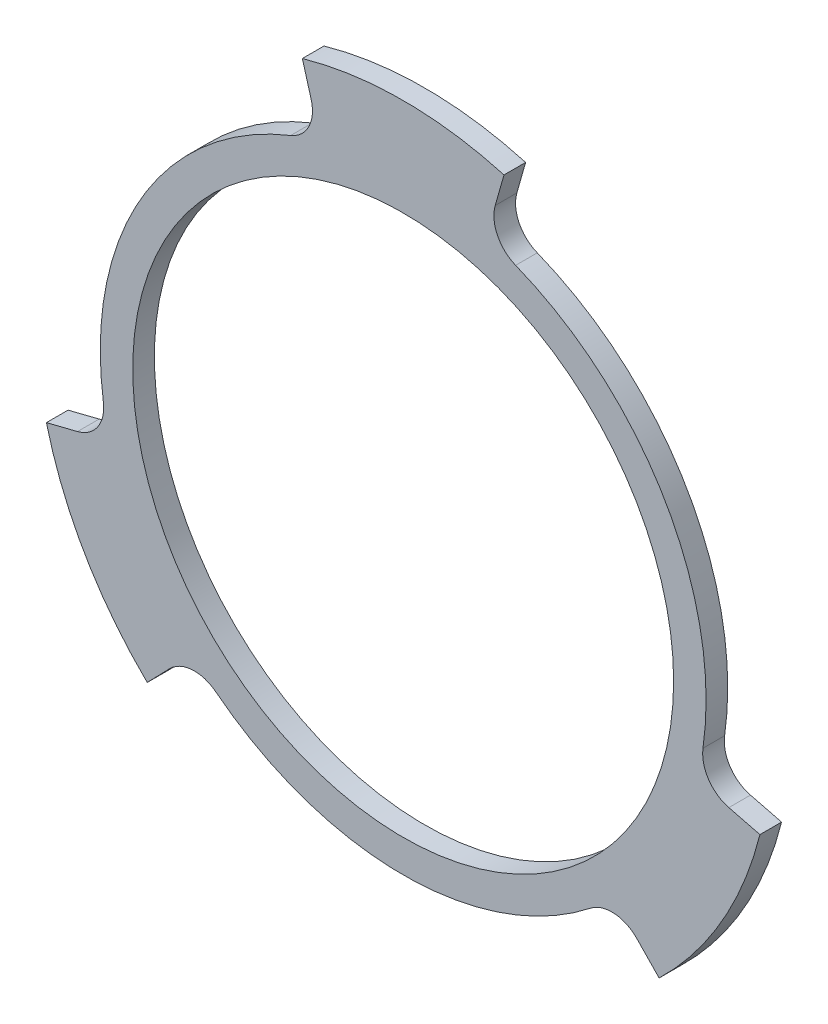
ISO-10303-21;
HEADER;
FILE_DESCRIPTION(('STEP AP214'),'2;1');
FILE_NAME('part.step','',(''),(''),'','','');
FILE_SCHEMA(('AUTOMOTIVE_DESIGN { 1 0 10303 214 1 1 1 1 }'));
ENDSEC;
DATA;
#1=APPLICATION_CONTEXT('core data for automotive mechanical design processes');
#2=APPLICATION_PROTOCOL_DEFINITION('international standard','automotive_design',2000,#1);
#3=PRODUCT_CONTEXT('',#1,'mechanical');
#4=PRODUCT('Part','Part','',(#3));
#5=PRODUCT_RELATED_PRODUCT_CATEGORY('part','',(#4));
#6=PRODUCT_DEFINITION_FORMATION('','',#4);
#7=PRODUCT_DEFINITION_CONTEXT('part definition',#1,'design');
#8=PRODUCT_DEFINITION('design','',#6,#7);
#9=PRODUCT_DEFINITION_SHAPE('','',#8);
#10=(LENGTH_UNIT() NAMED_UNIT(*) SI_UNIT(.MILLI.,.METRE.));
#11=(NAMED_UNIT(*) PLANE_ANGLE_UNIT() SI_UNIT($,.RADIAN.));
#12=(NAMED_UNIT(*) SI_UNIT($,.STERADIAN.) SOLID_ANGLE_UNIT());
#13=UNCERTAINTY_MEASURE_WITH_UNIT(LENGTH_MEASURE(1.E-05),#10,'distance_accuracy_value','');
#14=(GEOMETRIC_REPRESENTATION_CONTEXT(3) GLOBAL_UNCERTAINTY_ASSIGNED_CONTEXT((#13)) GLOBAL_UNIT_ASSIGNED_CONTEXT((#10,
#11,#12)) REPRESENTATION_CONTEXT('',''));
#15=CARTESIAN_POINT('',(0.,0.,0.));
#16=DIRECTION('',(0.,0.,1.));
#17=DIRECTION('',(1.,0.,0.));
#18=AXIS2_PLACEMENT_3D('',#15,#16,#17);
#19=CARTESIAN_POINT('',(0.,0.,1.5875));
#20=DIRECTION('',(0.,0.,-1.));
#21=DIRECTION('',(-1.,0.,0.));
#22=AXIS2_PLACEMENT_3D('',#19,#20,#21);
#23=CYLINDRICAL_SURFACE('',#22,22.225);
#24=CARTESIAN_POINT('',(0.,0.,0.));
#25=DIRECTION('',(0.,0.,1.));
#26=DIRECTION('',(1.,0.,0.));
#27=AXIS2_PLACEMENT_3D('',#24,#25,#26);
#28=CIRCLE('',#27,22.225);
#29=CARTESIAN_POINT('',(13.7457100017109,-17.4644233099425,0.));
#30=VERTEX_POINT('',#29);
#31=CARTESIAN_POINT('',(-13.7457100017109,-17.4644233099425,0.));
#32=VERTEX_POINT('',#31);
#33=EDGE_CURVE('E175',#30,#32,#28,.F.);
#34=ORIENTED_EDGE('',*,*,#33,.F.);
#35=DIRECTION('',(0.,0.,-1.));
#36=VECTOR('',#35,1.);
#37=CARTESIAN_POINT('',(13.7457100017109,-17.4644233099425,1.5875));
#38=LINE('',#37,#36);
#39=CARTESIAN_POINT('',(13.7457100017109,-17.4644233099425,1.5875));
#40=VERTEX_POINT('',#39);
#41=EDGE_CURVE('E277',#30,#40,#38,.F.);
#42=ORIENTED_EDGE('',*,*,#41,.T.);
#43=CARTESIAN_POINT('',(0.,0.,1.5875));
#44=DIRECTION('',(0.,0.,1.));
#45=DIRECTION('',(1.,0.,0.));
#46=AXIS2_PLACEMENT_3D('',#43,#44,#45);
#47=CIRCLE('',#46,22.225);
#48=CARTESIAN_POINT('',(-13.7457100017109,-17.4644233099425,1.5875));
#49=VERTEX_POINT('',#48);
#50=EDGE_CURVE('E213',#40,#49,#47,.F.);
#51=ORIENTED_EDGE('',*,*,#50,.T.);
#52=DIRECTION('',(0.,0.,-1.));
#53=VECTOR('',#52,1.);
#54=CARTESIAN_POINT('',(-13.7457100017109,-17.4644233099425,1.5875));
#55=LINE('',#54,#53);
#56=EDGE_CURVE('E274',#49,#32,#55,.T.);
#57=ORIENTED_EDGE('',*,*,#56,.T.);
#58=EDGE_LOOP('',(#34,#42,#51,#57));
#59=FACE_BOUND('',#58,.T.);
#60=ADVANCED_FACE('F31',(#59),#23,.T.);
#61=CARTESIAN_POINT('',(30.0624460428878,-31.0306665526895,1.5875));
#62=DIRECTION('',(-0.718223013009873,-0.695812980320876,0.));
#63=DIRECTION('',(0.695812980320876,-0.718223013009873,0.));
#64=AXIS2_PLACEMENT_3D('',#61,#62,#63);
#65=PLANE('',#64);
#66=DIRECTION('',(-0.695812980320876,0.718223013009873,0.));
#67=VECTOR('',#66,1.);
#68=CARTESIAN_POINT('',(30.0624460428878,-31.0306665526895,1.5875));
#69=LINE('',#68,#67);
#70=CARTESIAN_POINT('',(18.7782528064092,-19.3830435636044,1.5875));
#71=VERTEX_POINT('',#70);
#72=CARTESIAN_POINT('',(17.1409347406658,-17.6929924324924,1.5875));
#73=VERTEX_POINT('',#72);
#74=EDGE_CURVE('E216',#71,#73,#69,.T.);
#75=ORIENTED_EDGE('',*,*,#74,.T.);
#76=DIRECTION('',(0.,0.,1.));
#77=VECTOR('',#76,1.);
#78=CARTESIAN_POINT('',(17.1409347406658,-17.6929924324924,0.));
#79=LINE('',#78,#77);
#80=CARTESIAN_POINT('',(17.1409347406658,-17.6929924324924,0.));
#81=VERTEX_POINT('',#80);
#82=EDGE_CURVE('E173',#73,#81,#79,.F.);
#83=ORIENTED_EDGE('',*,*,#82,.T.);
#84=DIRECTION('',(-0.695812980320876,0.718223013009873,0.));
#85=VECTOR('',#84,1.);
#86=CARTESIAN_POINT('',(30.0624460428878,-31.0306665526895,0.));
#87=LINE('',#86,#85);
#88=CARTESIAN_POINT('',(18.7782528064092,-19.3830435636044,0.));
#89=VERTEX_POINT('',#88);
#90=EDGE_CURVE('E170',#89,#81,#87,.T.);
#91=ORIENTED_EDGE('',*,*,#90,.F.);
#92=DIRECTION('',(0.,0.,-1.));
#93=VECTOR('',#92,1.);
#94=CARTESIAN_POINT('',(18.7782528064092,-19.3830435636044,1.5875));
#95=LINE('',#94,#93);
#96=EDGE_CURVE('E155',#71,#89,#95,.T.);
#97=ORIENTED_EDGE('',*,*,#96,.F.);
#98=EDGE_LOOP('',(#75,#83,#91,#97));
#99=FACE_BOUND('',#98,.T.);
#100=ADVANCED_FACE('F171',(#99),#65,.T.);
#101=CARTESIAN_POINT('',(0.,0.,1.5875));
#102=DIRECTION('',(0.,0.,-1.));
#103=DIRECTION('',(-1.,0.,0.));
#104=AXIS2_PLACEMENT_3D('',#101,#102,#103);
#105=CYLINDRICAL_SURFACE('',#104,26.9875);
#106=CARTESIAN_POINT('',(0.,0.,0.));
#107=DIRECTION('',(0.,0.,1.));
#108=DIRECTION('',(1.,0.,0.));
#109=AXIS2_PLACEMENT_3D('',#106,#107,#108);
#110=CIRCLE('',#109,26.9875);
#111=CARTESIAN_POINT('',(26.1753345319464,-6.57092218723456,0.));
#112=VERTEX_POINT('',#111);
#113=EDGE_CURVE('E159',#112,#89,#110,.F.);
#114=ORIENTED_EDGE('',*,*,#113,.F.);
#115=DIRECTION('',(0.,0.,-1.));
#116=VECTOR('',#115,1.);
#117=CARTESIAN_POINT('',(26.1753345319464,-6.57092218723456,1.5875));
#118=LINE('',#117,#116);
#119=CARTESIAN_POINT('',(26.1753345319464,-6.57092218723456,1.5875));
#120=VERTEX_POINT('',#119);
#121=EDGE_CURVE('E166',#120,#112,#118,.T.);
#122=ORIENTED_EDGE('',*,*,#121,.F.);
#123=CARTESIAN_POINT('',(0.,0.,1.5875));
#124=DIRECTION('',(0.,0.,1.));
#125=DIRECTION('',(1.,0.,0.));
#126=AXIS2_PLACEMENT_3D('',#123,#124,#125);
#127=CIRCLE('',#126,26.9875);
#128=EDGE_CURVE('E161',#120,#71,#127,.F.);
#129=ORIENTED_EDGE('',*,*,#128,.T.);
#130=ORIENTED_EDGE('',*,*,#96,.T.);
#131=EDGE_LOOP('',(#114,#122,#129,#130));
#132=FACE_BOUND('',#131,.T.);
#133=ADVANCED_FACE('F157',(#132),#105,.T.);
#134=CARTESIAN_POINT('',(16.8141900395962,-4.22094832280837,1.5875));
#135=DIRECTION('',(-0.243480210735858,-0.969905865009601,0.));
#136=DIRECTION('',(0.969905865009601,-0.243480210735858,0.));
#137=AXIS2_PLACEMENT_3D('',#134,#135,#136);
#138=PLANE('',#137);
#139=DIRECTION('',(-0.969905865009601,0.243480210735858,0.));
#140=VECTOR('',#139,1.);
#141=CARTESIAN_POINT('',(16.8141900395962,-4.22094832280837,0.));
#142=LINE('',#141,#140);
#143=CARTESIAN_POINT('',(23.8930482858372,-5.99798871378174,0.));
#144=VERTEX_POINT('',#143);
#145=EDGE_CURVE('E181',#112,#144,#142,.T.);
#146=ORIENTED_EDGE('',*,*,#145,.T.);
#147=DIRECTION('',(0.,0.,1.));
#148=VECTOR('',#147,1.);
#149=CARTESIAN_POINT('',(23.8930482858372,-5.99798871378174,1.5875));
#150=LINE('',#149,#148);
#151=CARTESIAN_POINT('',(23.8930482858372,-5.99798871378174,1.5875));
#152=VERTEX_POINT('',#151);
#153=EDGE_CURVE('E268',#144,#152,#150,.T.);
#154=ORIENTED_EDGE('',*,*,#153,.T.);
#155=DIRECTION('',(-0.969905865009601,0.243480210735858,0.));
#156=VECTOR('',#155,1.);
#157=CARTESIAN_POINT('',(16.8141900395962,-4.22094832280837,1.5875));
#158=LINE('',#157,#156);
#159=EDGE_CURVE('E219',#120,#152,#158,.T.);
#160=ORIENTED_EDGE('',*,*,#159,.F.);
#161=ORIENTED_EDGE('',*,*,#121,.T.);
#162=EDGE_LOOP('',(#146,#154,#160,#161));
#163=FACE_BOUND('',#162,.T.);
#164=ADVANCED_FACE('F380',(#163),#138,.F.);
#165=CARTESIAN_POINT('',(0.,0.,1.5875));
#166=DIRECTION('',(0.,0.,-1.));
#167=DIRECTION('',(-1.,0.,0.));
#168=AXIS2_PLACEMENT_3D('',#165,#166,#167);
#169=CYLINDRICAL_SURFACE('',#168,22.225);
#170=CARTESIAN_POINT('',(0.,0.,1.5875));
#171=DIRECTION('',(0.,0.,1.));
#172=DIRECTION('',(1.,0.,0.));
#173=AXIS2_PLACEMENT_3D('',#170,#171,#172);
#174=CIRCLE('',#173,22.225);
#175=CARTESIAN_POINT('',(21.9974892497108,-3.17192239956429,1.5875));
#176=VERTEX_POINT('',#175);
#177=CARTESIAN_POINT('',(8.25177924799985,20.6363457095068,1.5875));
#178=VERTEX_POINT('',#177);
#179=EDGE_CURVE('E222',#176,#178,#174,.T.);
#180=ORIENTED_EDGE('',*,*,#179,.F.);
#181=DIRECTION('',(0.,0.,-1.));
#182=VECTOR('',#181,1.);
#183=CARTESIAN_POINT('',(21.9974892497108,-3.17192239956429,1.5875));
#184=LINE('',#183,#182);
#185=CARTESIAN_POINT('',(21.9974892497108,-3.17192239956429,0.));
#186=VERTEX_POINT('',#185);
#187=EDGE_CURVE('E265',#176,#186,#184,.T.);
#188=ORIENTED_EDGE('',*,*,#187,.T.);
#189=CARTESIAN_POINT('',(0.,0.,0.));
#190=DIRECTION('',(0.,0.,1.));
#191=DIRECTION('',(1.,0.,0.));
#192=AXIS2_PLACEMENT_3D('',#189,#190,#191);
#193=CIRCLE('',#192,22.225);
#194=CARTESIAN_POINT('',(8.25177924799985,20.6363457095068,0.));
#195=VERTEX_POINT('',#194);
#196=EDGE_CURVE('E183',#186,#195,#193,.T.);
#197=ORIENTED_EDGE('',*,*,#196,.T.);
#198=DIRECTION('',(0.,0.,-1.));
#199=VECTOR('',#198,1.);
#200=CARTESIAN_POINT('',(8.25177924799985,20.6363457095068,1.5875));
#201=LINE('',#200,#199);
#202=EDGE_CURVE('E263',#195,#178,#201,.F.);
#203=ORIENTED_EDGE('',*,*,#202,.T.);
#204=EDGE_LOOP('',(#180,#188,#197,#203));
#205=FACE_BOUND('',#204,.T.);
#206=ADVANCED_FACE('F343',(#205),#169,.T.);
#207=CARTESIAN_POINT('',(-14.6457615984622,-51.38723743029,1.5875));
#208=DIRECTION('',(0.961703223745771,-0.274092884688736,0.));
#209=DIRECTION('',(0.274092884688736,0.961703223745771,0.));
#210=AXIS2_PLACEMENT_3D('',#207,#208,#209);
#211=PLANE('',#210);
#212=DIRECTION('',(-0.274092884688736,-0.961703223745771,0.));
#213=VECTOR('',#212,1.);
#214=CARTESIAN_POINT('',(-14.6457615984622,-51.38723743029,1.5875));
#215=LINE('',#214,#213);
#216=CARTESIAN_POINT('',(7.39708172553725,25.953965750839,1.5875));
#217=VERTEX_POINT('',#216);
#218=CARTESIAN_POINT('',(6.7521135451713,23.6909811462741,1.5875));
#219=VERTEX_POINT('',#218);
#220=EDGE_CURVE('E225',#217,#219,#215,.T.);
#221=ORIENTED_EDGE('',*,*,#220,.T.);
#222=DIRECTION('',(0.,0.,-1.));
#223=VECTOR('',#222,1.);
#224=CARTESIAN_POINT('',(6.75211354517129,23.6909811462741,1.5875));
#225=LINE('',#224,#223);
#226=CARTESIAN_POINT('',(6.7521135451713,23.6909811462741,0.));
#227=VERTEX_POINT('',#226);
#228=EDGE_CURVE('E270',#219,#227,#225,.T.);
#229=ORIENTED_EDGE('',*,*,#228,.T.);
#230=DIRECTION('',(-0.274092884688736,-0.961703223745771,0.));
#231=VECTOR('',#230,1.);
#232=CARTESIAN_POINT('',(-14.6457615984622,-51.38723743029,0.));
#233=LINE('',#232,#231);
#234=CARTESIAN_POINT('',(7.39708172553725,25.953965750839,0.));
#235=VERTEX_POINT('',#234);
#236=EDGE_CURVE('E189',#235,#227,#233,.T.);
#237=ORIENTED_EDGE('',*,*,#236,.F.);
#238=DIRECTION('',(0.,0.,-1.));
#239=VECTOR('',#238,1.);
#240=CARTESIAN_POINT('',(7.39708172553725,25.953965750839,1.5875));
#241=LINE('',#240,#239);
#242=EDGE_CURVE('E254',#217,#235,#241,.T.);
#243=ORIENTED_EDGE('',*,*,#242,.F.);
#244=EDGE_LOOP('',(#221,#229,#237,#243));
#245=FACE_BOUND('',#244,.T.);
#246=ADVANCED_FACE('F351',(#245),#211,.T.);
#247=CARTESIAN_POINT('',(0.,0.,1.5875));
#248=DIRECTION('',(0.,0.,-1.));
#249=DIRECTION('',(-1.,0.,0.));
#250=AXIS2_PLACEMENT_3D('',#247,#248,#249);
#251=CYLINDRICAL_SURFACE('',#250,26.9875);
#252=CARTESIAN_POINT('',(0.,0.,0.));
#253=DIRECTION('',(0.,0.,1.));
#254=DIRECTION('',(1.,0.,0.));
#255=AXIS2_PLACEMENT_3D('',#252,#253,#254);
#256=CIRCLE('',#255,26.9875);
#257=CARTESIAN_POINT('',(-7.39708172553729,25.953965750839,0.));
#258=VERTEX_POINT('',#257);
#259=EDGE_CURVE('E192',#258,#235,#256,.F.);
#260=ORIENTED_EDGE('',*,*,#259,.F.);
#261=DIRECTION('',(0.,0.,-1.));
#262=VECTOR('',#261,1.);
#263=CARTESIAN_POINT('',(-7.39708172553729,25.953965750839,1.5875));
#264=LINE('',#263,#262);
#265=CARTESIAN_POINT('',(-7.39708172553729,25.953965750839,1.5875));
#266=VERTEX_POINT('',#265);
#267=EDGE_CURVE('E252',#266,#258,#264,.T.);
#268=ORIENTED_EDGE('',*,*,#267,.F.);
#269=CARTESIAN_POINT('',(0.,0.,1.5875));
#270=DIRECTION('',(0.,0.,1.));
#271=DIRECTION('',(1.,0.,0.));
#272=AXIS2_PLACEMENT_3D('',#269,#270,#271);
#273=CIRCLE('',#272,26.9875);
#274=EDGE_CURVE('E228',#266,#217,#273,.F.);
#275=ORIENTED_EDGE('',*,*,#274,.T.);
#276=ORIENTED_EDGE('',*,*,#242,.T.);
#277=EDGE_LOOP('',(#260,#268,#275,#276));
#278=FACE_BOUND('',#277,.T.);
#279=ADVANCED_FACE('F356',(#278),#251,.T.);
#280=CARTESIAN_POINT('',(15.1962634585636,-53.3187702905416,1.5875));
#281=DIRECTION('',(0.96170322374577,0.274092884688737,0.));
#282=DIRECTION('',(-0.274092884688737,0.96170322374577,0.));
#283=AXIS2_PLACEMENT_3D('',#280,#281,#282);
#284=PLANE('',#283);
#285=DIRECTION('',(0.274092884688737,-0.96170322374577,0.));
#286=VECTOR('',#285,1.);
#287=CARTESIAN_POINT('',(15.1962634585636,-53.3187702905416,0.));
#288=LINE('',#287,#286);
#289=CARTESIAN_POINT('',(-6.75211354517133,23.6909811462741,0.));
#290=VERTEX_POINT('',#289);
#291=EDGE_CURVE('E195',#258,#290,#288,.T.);
#292=ORIENTED_EDGE('',*,*,#291,.T.);
#293=DIRECTION('',(0.,0.,-1.));
#294=VECTOR('',#293,1.);
#295=CARTESIAN_POINT('',(-6.75211354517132,23.6909811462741,1.5875));
#296=LINE('',#295,#294);
#297=CARTESIAN_POINT('',(-6.75211354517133,23.6909811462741,1.5875));
#298=VERTEX_POINT('',#297);
#299=EDGE_CURVE('E261',#290,#298,#296,.F.);
#300=ORIENTED_EDGE('',*,*,#299,.T.);
#301=DIRECTION('',(0.274092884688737,-0.96170322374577,0.));
#302=VECTOR('',#301,1.);
#303=CARTESIAN_POINT('',(15.1962634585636,-53.3187702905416,1.5875));
#304=LINE('',#303,#302);
#305=EDGE_CURVE('E231',#266,#298,#304,.T.);
#306=ORIENTED_EDGE('',*,*,#305,.F.);
#307=ORIENTED_EDGE('',*,*,#267,.T.);
#308=EDGE_LOOP('',(#292,#300,#306,#307));
#309=FACE_BOUND('',#308,.T.);
#310=ADVANCED_FACE('F360',(#309),#284,.F.);
#311=CARTESIAN_POINT('',(0.,0.,1.5875));
#312=DIRECTION('',(0.,0.,-1.));
#313=DIRECTION('',(-1.,0.,0.));
#314=AXIS2_PLACEMENT_3D('',#311,#312,#313);
#315=CYLINDRICAL_SURFACE('',#314,22.225);
#316=CARTESIAN_POINT('',(0.,0.,1.5875));
#317=DIRECTION('',(0.,0.,1.));
#318=DIRECTION('',(1.,0.,0.));
#319=AXIS2_PLACEMENT_3D('',#316,#317,#318);
#320=CIRCLE('',#319,22.225);
#321=CARTESIAN_POINT('',(-21.9974892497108,-3.17192239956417,1.5875));
#322=VERTEX_POINT('',#321);
#323=CARTESIAN_POINT('',(-8.25177924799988,20.6363457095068,1.5875));
#324=VERTEX_POINT('',#323);
#325=EDGE_CURVE('E234',#322,#324,#320,.F.);
#326=ORIENTED_EDGE('',*,*,#325,.T.);
#327=DIRECTION('',(0.,0.,-1.));
#328=VECTOR('',#327,1.);
#329=CARTESIAN_POINT('',(-8.25177924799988,20.6363457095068,1.5875));
#330=LINE('',#329,#328);
#331=CARTESIAN_POINT('',(-8.25177924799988,20.6363457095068,0.));
#332=VERTEX_POINT('',#331);
#333=EDGE_CURVE('E258',#324,#332,#330,.T.);
#334=ORIENTED_EDGE('',*,*,#333,.T.);
#335=CARTESIAN_POINT('',(0.,0.,0.));
#336=DIRECTION('',(0.,0.,1.));
#337=DIRECTION('',(1.,0.,0.));
#338=AXIS2_PLACEMENT_3D('',#335,#336,#337);
#339=CIRCLE('',#338,22.225);
#340=CARTESIAN_POINT('',(-21.9974892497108,-3.17192239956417,0.));
#341=VERTEX_POINT('',#340);
#342=EDGE_CURVE('E198',#341,#332,#339,.F.);
#343=ORIENTED_EDGE('',*,*,#342,.F.);
#344=DIRECTION('',(0.,0.,-1.));
#345=VECTOR('',#344,1.);
#346=CARTESIAN_POINT('',(-21.9974892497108,-3.17192239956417,1.5875));
#347=LINE('',#346,#345);
#348=EDGE_CURVE('E165',#341,#322,#347,.F.);
#349=ORIENTED_EDGE('',*,*,#348,.T.);
#350=EDGE_LOOP('',(#326,#334,#343,#349));
#351=FACE_BOUND('',#350,.T.);
#352=ADVANCED_FACE('F305',(#351),#315,.T.);
#353=CARTESIAN_POINT('',(-9.92096529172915,-2.4905084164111,1.5875));
#354=DIRECTION('',(-0.243480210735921,0.969905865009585,0.));
#355=DIRECTION('',(-0.969905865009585,-0.243480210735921,0.));
#356=AXIS2_PLACEMENT_3D('',#353,#354,#355);
#357=PLANE('',#356);
#358=DIRECTION('',(0.969905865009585,0.243480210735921,0.));
#359=VECTOR('',#358,1.);
#360=CARTESIAN_POINT('',(-9.92096529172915,-2.4905084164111,1.5875));
#361=LINE('',#360,#359);
#362=CARTESIAN_POINT('',(-26.1753345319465,-6.57092218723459,1.5875));
#363=VERTEX_POINT('',#362);
#364=CARTESIAN_POINT('',(-23.8930482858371,-5.99798871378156,1.5875));
#365=VERTEX_POINT('',#364);
#366=EDGE_CURVE('E237',#363,#365,#361,.T.);
#367=ORIENTED_EDGE('',*,*,#366,.T.);
#368=DIRECTION('',(0.,0.,1.));
#369=VECTOR('',#368,1.);
#370=CARTESIAN_POINT('',(-23.8930482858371,-5.99798871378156,0.));
#371=LINE('',#370,#369);
#372=CARTESIAN_POINT('',(-23.8930482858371,-5.99798871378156,0.));
#373=VERTEX_POINT('',#372);
#374=EDGE_CURVE('E281',#365,#373,#371,.F.);
#375=ORIENTED_EDGE('',*,*,#374,.T.);
#376=DIRECTION('',(0.969905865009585,0.243480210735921,0.));
#377=VECTOR('',#376,1.);
#378=CARTESIAN_POINT('',(-9.92096529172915,-2.4905084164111,0.));
#379=LINE('',#378,#377);
#380=CARTESIAN_POINT('',(-26.1753345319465,-6.57092218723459,0.));
#381=VERTEX_POINT('',#380);
#382=EDGE_CURVE('E201',#381,#373,#379,.T.);
#383=ORIENTED_EDGE('',*,*,#382,.F.);
#384=DIRECTION('',(0.,0.,-1.));
#385=VECTOR('',#384,1.);
#386=CARTESIAN_POINT('',(-26.1753345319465,-6.57092218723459,1.5875));
#387=LINE('',#386,#385);
#388=EDGE_CURVE('E250',#363,#381,#387,.T.);
#389=ORIENTED_EDGE('',*,*,#388,.F.);
#390=EDGE_LOOP('',(#367,#375,#383,#389));
#391=FACE_BOUND('',#390,.T.);
#392=ADVANCED_FACE('F309',(#391),#357,.T.);
#393=CARTESIAN_POINT('',(0.,0.,1.5875));
#394=DIRECTION('',(0.,0.,-1.));
#395=DIRECTION('',(-1.,0.,0.));
#396=AXIS2_PLACEMENT_3D('',#393,#394,#395);
#397=CYLINDRICAL_SURFACE('',#396,26.9875);
#398=CARTESIAN_POINT('',(0.,0.,0.));
#399=DIRECTION('',(0.,0.,1.));
#400=DIRECTION('',(1.,0.,0.));
#401=AXIS2_PLACEMENT_3D('',#398,#399,#400);
#402=CIRCLE('',#401,26.9875);
#403=CARTESIAN_POINT('',(-18.7782528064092,-19.3830435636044,0.));
#404=VERTEX_POINT('',#403);
#405=EDGE_CURVE('E204',#404,#381,#402,.F.);
#406=ORIENTED_EDGE('',*,*,#405,.F.);
#407=DIRECTION('',(0.,0.,-1.));
#408=VECTOR('',#407,1.);
#409=CARTESIAN_POINT('',(-18.7782528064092,-19.3830435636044,1.5875));
#410=LINE('',#409,#408);
#411=CARTESIAN_POINT('',(-18.7782528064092,-19.3830435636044,1.5875));
#412=VERTEX_POINT('',#411);
#413=EDGE_CURVE('E248',#412,#404,#410,.T.);
#414=ORIENTED_EDGE('',*,*,#413,.F.);
#415=CARTESIAN_POINT('',(0.,0.,1.5875));
#416=DIRECTION('',(0.,0.,1.));
#417=DIRECTION('',(1.,0.,0.));
#418=AXIS2_PLACEMENT_3D('',#415,#416,#417);
#419=CIRCLE('',#418,26.9875);
#420=EDGE_CURVE('E239',#412,#363,#419,.F.);
#421=ORIENTED_EDGE('',*,*,#420,.T.);
#422=ORIENTED_EDGE('',*,*,#388,.T.);
#423=EDGE_LOOP('',(#406,#414,#421,#422));
#424=FACE_BOUND('',#423,.T.);
#425=ADVANCED_FACE('F316',(#424),#397,.T.);
#426=CARTESIAN_POINT('',(-26.5147343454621,-27.3686937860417,1.5875));
#427=DIRECTION('',(-0.718223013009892,0.695812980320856,0.));
#428=DIRECTION('',(-0.695812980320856,-0.718223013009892,0.));
#429=AXIS2_PLACEMENT_3D('',#426,#427,#428);
#430=PLANE('',#429);
#431=DIRECTION('',(0.695812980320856,0.718223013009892,0.));
#432=VECTOR('',#431,1.);
#433=CARTESIAN_POINT('',(-26.5147343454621,-27.3686937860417,0.));
#434=LINE('',#433,#432);
#435=CARTESIAN_POINT('',(-17.1409347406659,-17.6929924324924,0.));
#436=VERTEX_POINT('',#435);
#437=EDGE_CURVE('E207',#404,#436,#434,.T.);
#438=ORIENTED_EDGE('',*,*,#437,.T.);
#439=DIRECTION('',(0.,0.,-1.));
#440=VECTOR('',#439,1.);
#441=CARTESIAN_POINT('',(-17.1409347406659,-17.6929924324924,1.5875));
#442=LINE('',#441,#440);
#443=CARTESIAN_POINT('',(-17.1409347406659,-17.6929924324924,1.5875));
#444=VERTEX_POINT('',#443);
#445=EDGE_CURVE('E279',#436,#444,#442,.F.);
#446=ORIENTED_EDGE('',*,*,#445,.T.);
#447=DIRECTION('',(0.695812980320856,0.718223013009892,0.));
#448=VECTOR('',#447,1.);
#449=CARTESIAN_POINT('',(-26.5147343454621,-27.3686937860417,1.5875));
#450=LINE('',#449,#448);
#451=EDGE_CURVE('E242',#412,#444,#450,.T.);
#452=ORIENTED_EDGE('',*,*,#451,.F.);
#453=ORIENTED_EDGE('',*,*,#413,.T.);
#454=EDGE_LOOP('',(#438,#446,#452,#453));
#455=FACE_BOUND('',#454,.T.);
#456=ADVANCED_FACE('F320',(#455),#430,.F.);
#457=CARTESIAN_POINT('',(0.,0.,1.5875));
#458=DIRECTION('',(0.,0.,-1.));
#459=DIRECTION('',(-1.,0.,0.));
#460=AXIS2_PLACEMENT_3D('',#457,#458,#459);
#461=CYLINDRICAL_SURFACE('',#460,19.84375);
#462=CARTESIAN_POINT('',(0.,0.,1.5875));
#463=DIRECTION('',(0.,0.,1.));
#464=DIRECTION('',(1.,0.,0.));
#465=AXIS2_PLACEMENT_3D('',#462,#463,#464);
#466=CIRCLE('',#465,19.84375);
#467=CARTESIAN_POINT('',(19.84375,0.,1.5875));
#468=VERTEX_POINT('',#467);
#469=EDGE_CURVE('E245',#468,#468,#466,.T.);
#470=ORIENTED_EDGE('',*,*,#469,.T.);
#471=EDGE_LOOP('',(#470));
#472=FACE_BOUND('',#471,.T.);
#473=CARTESIAN_POINT('',(0.,0.,0.));
#474=DIRECTION('',(0.,0.,1.));
#475=DIRECTION('',(1.,0.,0.));
#476=AXIS2_PLACEMENT_3D('',#473,#474,#475);
#477=CIRCLE('',#476,19.84375);
#478=CARTESIAN_POINT('',(19.84375,0.,0.));
#479=VERTEX_POINT('',#478);
#480=EDGE_CURVE('E210',#479,#479,#477,.T.);
#481=ORIENTED_EDGE('',*,*,#480,.F.);
#482=EDGE_LOOP('',(#481));
#483=FACE_BOUND('',#482,.T.);
#484=ADVANCED_FACE('F401',(#472,#483),#461,.F.);
#485=CARTESIAN_POINT('',(3.66381276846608,-56.6056082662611,1.5875));
#486=DIRECTION('',(0.,0.,1.));
#487=DIRECTION('',(1.,0.,0.));
#488=AXIS2_PLACEMENT_3D('',#485,#486,#487);
#489=PLANE('',#488);
#490=ORIENTED_EDGE('',*,*,#50,.F.);
#491=CARTESIAN_POINT('',(15.3166482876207,-19.4603574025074,1.5875));
#492=DIRECTION('',(0.,0.,1.));
#493=DIRECTION('',(1.,0.,0.));
#494=AXIS2_PLACEMENT_3D('',#491,#492,#493);
#495=CIRCLE('',#494,2.54);
#496=EDGE_CURVE('E297',#40,#73,#495,.F.);
#497=ORIENTED_EDGE('',*,*,#496,.T.);
#498=ORIENTED_EDGE('',*,*,#74,.F.);
#499=ORIENTED_EDGE('',*,*,#128,.F.);
#500=ORIENTED_EDGE('',*,*,#159,.T.);
#501=CARTESIAN_POINT('',(24.5114880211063,-3.53442781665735,1.5875));
#502=DIRECTION('',(0.,0.,1.));
#503=DIRECTION('',(1.,0.,0.));
#504=AXIS2_PLACEMENT_3D('',#501,#502,#503);
#505=CIRCLE('',#504,2.54);
#506=EDGE_CURVE('E289',#152,#176,#505,.F.);
#507=ORIENTED_EDGE('',*,*,#506,.T.);
#508=ORIENTED_EDGE('',*,*,#179,.T.);
#509=CARTESIAN_POINT('',(9.19483973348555,22.9947852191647,1.5875));
#510=DIRECTION('',(0.,0.,1.));
#511=DIRECTION('',(1.,0.,0.));
#512=AXIS2_PLACEMENT_3D('',#509,#510,#511);
#513=CIRCLE('',#512,2.54);
#514=EDGE_CURVE('E293',#178,#219,#513,.F.);
#515=ORIENTED_EDGE('',*,*,#514,.T.);
#516=ORIENTED_EDGE('',*,*,#220,.F.);
#517=ORIENTED_EDGE('',*,*,#274,.F.);
#518=ORIENTED_EDGE('',*,*,#305,.T.);
#519=CARTESIAN_POINT('',(-9.19483973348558,22.9947852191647,1.5875));
#520=DIRECTION('',(0.,0.,1.));
#521=DIRECTION('',(1.,0.,0.));
#522=AXIS2_PLACEMENT_3D('',#519,#520,#521);
#523=CIRCLE('',#522,2.54);
#524=EDGE_CURVE('E285',#298,#324,#523,.F.);
#525=ORIENTED_EDGE('',*,*,#524,.T.);
#526=ORIENTED_EDGE('',*,*,#325,.F.);
#527=CARTESIAN_POINT('',(-24.5114880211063,-3.53442781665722,1.5875));
#528=DIRECTION('',(0.,0.,1.));
#529=DIRECTION('',(1.,0.,0.));
#530=AXIS2_PLACEMENT_3D('',#527,#528,#529);
#531=CIRCLE('',#530,2.54);
#532=EDGE_CURVE('E11',#322,#365,#531,.F.);
#533=ORIENTED_EDGE('',*,*,#532,.T.);
#534=ORIENTED_EDGE('',*,*,#366,.F.);
#535=ORIENTED_EDGE('',*,*,#420,.F.);
#536=ORIENTED_EDGE('',*,*,#451,.T.);
#537=CARTESIAN_POINT('',(-15.3166482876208,-19.4603574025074,1.5875));
#538=DIRECTION('',(0.,0.,1.));
#539=DIRECTION('',(1.,0.,0.));
#540=AXIS2_PLACEMENT_3D('',#537,#538,#539);
#541=CIRCLE('',#540,2.54);
#542=EDGE_CURVE('E301',#444,#49,#541,.F.);
#543=ORIENTED_EDGE('',*,*,#542,.T.);
#544=EDGE_LOOP('',(#490,#497,#498,#499,#500,#507,#508,#515,#516,#517,#518,#525,#526,#533,#534,
#535,#536,#543));
#545=FACE_BOUND('',#544,.T.);
#546=ORIENTED_EDGE('',*,*,#469,.F.);
#547=EDGE_LOOP('',(#546));
#548=FACE_BOUND('',#547,.T.);
#549=ADVANCED_FACE('F312',(#545,#548),#489,.T.);
#550=CARTESIAN_POINT('',(3.66381276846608,-56.6056082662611,0.));
#551=DIRECTION('',(0.,0.,1.));
#552=DIRECTION('',(1.,0.,0.));
#553=AXIS2_PLACEMENT_3D('',#550,#551,#552);
#554=PLANE('',#553);
#555=ORIENTED_EDGE('',*,*,#90,.T.);
#556=CARTESIAN_POINT('',(15.3166482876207,-19.4603574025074,0.));
#557=DIRECTION('',(0.,0.,1.));
#558=DIRECTION('',(1.,0.,0.));
#559=AXIS2_PLACEMENT_3D('',#556,#557,#558);
#560=CIRCLE('',#559,2.54);
#561=EDGE_CURVE('E295',#81,#30,#560,.T.);
#562=ORIENTED_EDGE('',*,*,#561,.T.);
#563=ORIENTED_EDGE('',*,*,#33,.T.);
#564=CARTESIAN_POINT('',(-15.3166482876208,-19.4603574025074,0.));
#565=DIRECTION('',(0.,0.,1.));
#566=DIRECTION('',(1.,0.,0.));
#567=AXIS2_PLACEMENT_3D('',#564,#565,#566);
#568=CIRCLE('',#567,2.54);
#569=EDGE_CURVE('E299',#32,#436,#568,.T.);
#570=ORIENTED_EDGE('',*,*,#569,.T.);
#571=ORIENTED_EDGE('',*,*,#437,.F.);
#572=ORIENTED_EDGE('',*,*,#405,.T.);
#573=ORIENTED_EDGE('',*,*,#382,.T.);
#574=CARTESIAN_POINT('',(-24.5114880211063,-3.53442781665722,0.));
#575=DIRECTION('',(0.,0.,1.));
#576=DIRECTION('',(1.,0.,0.));
#577=AXIS2_PLACEMENT_3D('',#574,#575,#576);
#578=CIRCLE('',#577,2.54);
#579=EDGE_CURVE('E38',#373,#341,#578,.T.);
#580=ORIENTED_EDGE('',*,*,#579,.T.);
#581=ORIENTED_EDGE('',*,*,#342,.T.);
#582=CARTESIAN_POINT('',(-9.19483973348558,22.9947852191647,0.));
#583=DIRECTION('',(0.,0.,1.));
#584=DIRECTION('',(1.,0.,0.));
#585=AXIS2_PLACEMENT_3D('',#582,#583,#584);
#586=CIRCLE('',#585,2.54);
#587=EDGE_CURVE('E283',#332,#290,#586,.T.);
#588=ORIENTED_EDGE('',*,*,#587,.T.);
#589=ORIENTED_EDGE('',*,*,#291,.F.);
#590=ORIENTED_EDGE('',*,*,#259,.T.);
#591=ORIENTED_EDGE('',*,*,#236,.T.);
#592=CARTESIAN_POINT('',(9.19483973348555,22.9947852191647,0.));
#593=DIRECTION('',(0.,0.,1.));
#594=DIRECTION('',(1.,0.,0.));
#595=AXIS2_PLACEMENT_3D('',#592,#593,#594);
#596=CIRCLE('',#595,2.54);
#597=EDGE_CURVE('E291',#227,#195,#596,.T.);
#598=ORIENTED_EDGE('',*,*,#597,.T.);
#599=ORIENTED_EDGE('',*,*,#196,.F.);
#600=CARTESIAN_POINT('',(24.5114880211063,-3.53442781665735,0.));
#601=DIRECTION('',(0.,0.,1.));
#602=DIRECTION('',(1.,0.,0.));
#603=AXIS2_PLACEMENT_3D('',#600,#601,#602);
#604=CIRCLE('',#603,2.54);
#605=EDGE_CURVE('E287',#186,#144,#604,.T.);
#606=ORIENTED_EDGE('',*,*,#605,.T.);
#607=ORIENTED_EDGE('',*,*,#145,.F.);
#608=ORIENTED_EDGE('',*,*,#113,.T.);
#609=EDGE_LOOP('',(#555,#562,#563,#570,#571,#572,#573,#580,#581,#588,#589,#590,#591,#598,#599,
#606,#607,#608));
#610=FACE_BOUND('',#609,.T.);
#611=ORIENTED_EDGE('',*,*,#480,.T.);
#612=EDGE_LOOP('',(#611));
#613=FACE_BOUND('',#612,.T.);
#614=ADVANCED_FACE('F178',(#610,#613),#554,.F.);
#615=CARTESIAN_POINT('',(-9.19483973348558,22.9947852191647,1.5875));
#616=DIRECTION('',(0.,0.,-1.));
#617=DIRECTION('',(-1.,0.,0.));
#618=AXIS2_PLACEMENT_3D('',#615,#616,#617);
#619=CYLINDRICAL_SURFACE('',#618,2.54);
#620=ORIENTED_EDGE('',*,*,#524,.F.);
#621=ORIENTED_EDGE('',*,*,#299,.F.);
#622=ORIENTED_EDGE('',*,*,#587,.F.);
#623=ORIENTED_EDGE('',*,*,#333,.F.);
#624=EDGE_LOOP('',(#620,#621,#622,#623));
#625=FACE_BOUND('',#624,.T.);
#626=ADVANCED_FACE('F364',(#625),#619,.F.);
#627=CARTESIAN_POINT('',(24.5114880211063,-3.53442781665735,1.5875));
#628=DIRECTION('',(0.,0.,-1.));
#629=DIRECTION('',(-1.,0.,0.));
#630=AXIS2_PLACEMENT_3D('',#627,#628,#629);
#631=CYLINDRICAL_SURFACE('',#630,2.54);
#632=ORIENTED_EDGE('',*,*,#506,.F.);
#633=ORIENTED_EDGE('',*,*,#153,.F.);
#634=ORIENTED_EDGE('',*,*,#605,.F.);
#635=ORIENTED_EDGE('',*,*,#187,.F.);
#636=EDGE_LOOP('',(#632,#633,#634,#635));
#637=FACE_BOUND('',#636,.T.);
#638=ADVANCED_FACE('F340',(#637),#631,.F.);
#639=CARTESIAN_POINT('',(9.19483973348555,22.9947852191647,1.5875));
#640=DIRECTION('',(0.,0.,-1.));
#641=DIRECTION('',(-1.,0.,0.));
#642=AXIS2_PLACEMENT_3D('',#639,#640,#641);
#643=CYLINDRICAL_SURFACE('',#642,2.54);
#644=ORIENTED_EDGE('',*,*,#514,.F.);
#645=ORIENTED_EDGE('',*,*,#202,.F.);
#646=ORIENTED_EDGE('',*,*,#597,.F.);
#647=ORIENTED_EDGE('',*,*,#228,.F.);
#648=EDGE_LOOP('',(#644,#645,#646,#647));
#649=FACE_BOUND('',#648,.T.);
#650=ADVANCED_FACE('F349',(#649),#643,.F.);
#651=CARTESIAN_POINT('',(15.3166482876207,-19.4603574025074,1.5875));
#652=DIRECTION('',(0.,0.,-1.));
#653=DIRECTION('',(-1.,0.,0.));
#654=AXIS2_PLACEMENT_3D('',#651,#652,#653);
#655=CYLINDRICAL_SURFACE('',#654,2.54);
#656=ORIENTED_EDGE('',*,*,#496,.F.);
#657=ORIENTED_EDGE('',*,*,#41,.F.);
#658=ORIENTED_EDGE('',*,*,#561,.F.);
#659=ORIENTED_EDGE('',*,*,#82,.F.);
#660=EDGE_LOOP('',(#656,#657,#658,#659));
#661=FACE_BOUND('',#660,.T.);
#662=ADVANCED_FACE('F332',(#661),#655,.F.);
#663=CARTESIAN_POINT('',(-15.3166482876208,-19.4603574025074,1.5875));
#664=DIRECTION('',(0.,0.,-1.));
#665=DIRECTION('',(-1.,0.,0.));
#666=AXIS2_PLACEMENT_3D('',#663,#664,#665);
#667=CYLINDRICAL_SURFACE('',#666,2.54);
#668=ORIENTED_EDGE('',*,*,#542,.F.);
#669=ORIENTED_EDGE('',*,*,#445,.F.);
#670=ORIENTED_EDGE('',*,*,#569,.F.);
#671=ORIENTED_EDGE('',*,*,#56,.F.);
#672=EDGE_LOOP('',(#668,#669,#670,#671));
#673=FACE_BOUND('',#672,.T.);
#674=ADVANCED_FACE('F325',(#673),#667,.F.);
#675=CARTESIAN_POINT('',(-24.5114880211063,-3.53442781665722,1.5875));
#676=DIRECTION('',(0.,0.,-1.));
#677=DIRECTION('',(-1.,0.,0.));
#678=AXIS2_PLACEMENT_3D('',#675,#676,#677);
#679=CYLINDRICAL_SURFACE('',#678,2.54);
#680=ORIENTED_EDGE('',*,*,#532,.F.);
#681=ORIENTED_EDGE('',*,*,#348,.F.);
#682=ORIENTED_EDGE('',*,*,#579,.F.);
#683=ORIENTED_EDGE('',*,*,#374,.F.);
#684=EDGE_LOOP('',(#680,#681,#682,#683));
#685=FACE_BOUND('',#684,.T.);
#686=ADVANCED_FACE('F307',(#685),#679,.F.);
#687=CLOSED_SHELL('',(#60,#100,#133,#164,#206,#246,#279,#310,#352,#392,#425,#456,#484,#549,#614,
#626,#638,#650,#662,#674,#686));
#688=MANIFOLD_SOLID_BREP('B2',#687);
#689=ADVANCED_BREP_SHAPE_REPRESENTATION('',(#18,#688),#14);
#690=SHAPE_DEFINITION_REPRESENTATION(#9,#689);
ENDSEC;
END-ISO-10303-21;
